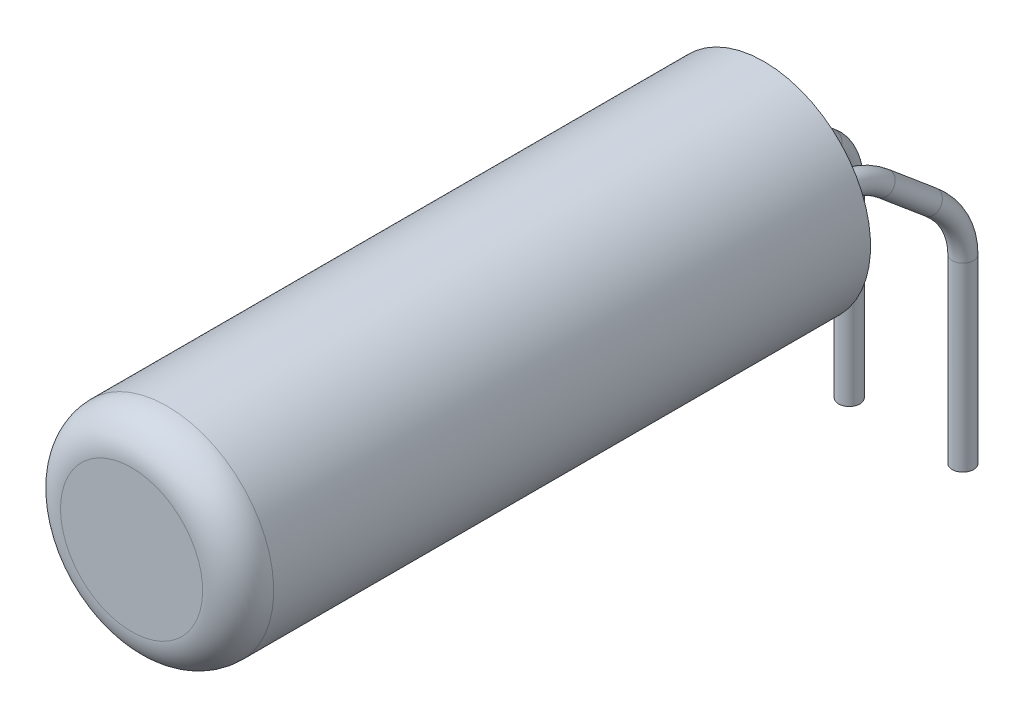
from build123d import *

# Parameters (mm, degrees)
SKETCH_2_R = 0.15
FILLET_1_R = 0.5


with BuildPart() as part:
    # Sketch 1 → Revolve 1 (revolve)
    with BuildSketch(Plane(origin=(0, 0, 0), x_dir=(0, 0, -1), z_dir=(1, 0, 0)), mode=Mode.PRIVATE) as revolve_1_sk:
        Polygon((-10.9, 1.5), (-2.2, 1.5), (-2.2, 0.2), (-2, 0.2), (-2, 0), (-10.9, 0), align=None)
    revolve(revolve_1_sk.sketch.rotate(Axis((0, 1.5, 2.2), (0, 0, 1)), 180), axis=Axis((0, 1.5, 2.2), (0, 0, 1)))

    # Sweep 1: sweep along a curve in space
    with BuildLine() as sweep_1_path:
        Line((0.55, 1.5, 2.2), (0.55, 1.5, 1.562049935))
        ThreePointArc((0.55, 1.5, 1.562049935), (0.564932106, 1.442168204, 1.221624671), (0.60794468, 1.275581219, 0.921865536))
        Line((0.60794468, 1.275581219, 0.921865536), (0.722467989, 0.832034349, 0.372153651))
        ThreePointArc((0.722467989, 0.832034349, 0.372153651), (0.779596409, 0.483291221, 0.097937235), (0.8, 0.047318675, 0))
        Line((0.8, 0.047318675, 0), (0.8, -2.5, 0))
    # Sketch 2 → Sweep 1 (sweep)
    with BuildSketch(Plane(origin=(0, 0, 2.2), x_dir=(-1, 0, 0), z_dir=(0, 0, -1))):
        with Locations((-0.55, 1.5)):
            Circle(SKETCH_2_R)
    sweep_1 = sweep(path=sweep_1_path.line)

    # Mirror 1: Sweep 1 across plane
    add(sweep_1.mirror(Plane(origin=(0, 0, 0), x_dir=(0, 0, 1), z_dir=(1, 0, 0))))

    # Fillet 1
    fillet_1_edges = [part.edges().sort_by_distance(p)[0] for p in [
        (0, 0, 10.9),
    ]]
    fillet(fillet_1_edges, radius=FILLET_1_R)


solid = part.part
